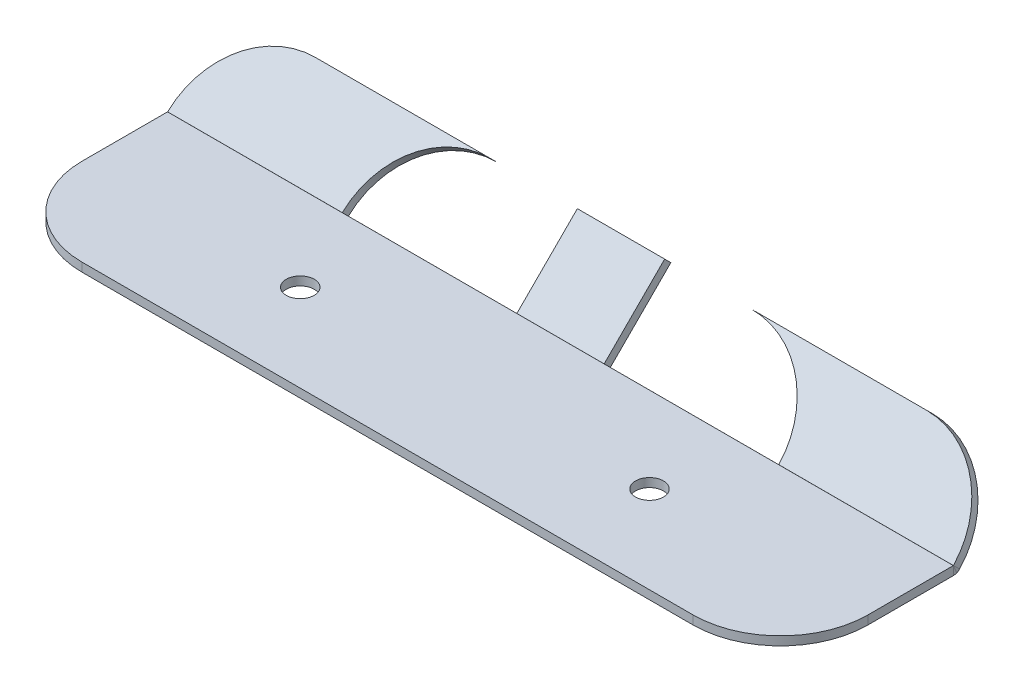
ISO-10303-21;
HEADER;
FILE_DESCRIPTION(('STEP AP214'),'2;1');
FILE_NAME('part.step','',(''),(''),'','','');
FILE_SCHEMA(('AUTOMOTIVE_DESIGN { 1 0 10303 214 1 1 1 1 }'));
ENDSEC;
DATA;
#1=APPLICATION_CONTEXT('core data for automotive mechanical design processes');
#2=APPLICATION_PROTOCOL_DEFINITION('international standard','automotive_design',2000,#1);
#3=PRODUCT_CONTEXT('',#1,'mechanical');
#4=PRODUCT('Part','Part','',(#3));
#5=PRODUCT_RELATED_PRODUCT_CATEGORY('part','',(#4));
#6=PRODUCT_DEFINITION_FORMATION('','',#4);
#7=PRODUCT_DEFINITION_CONTEXT('part definition',#1,'design');
#8=PRODUCT_DEFINITION('design','',#6,#7);
#9=PRODUCT_DEFINITION_SHAPE('','',#8);
#10=(LENGTH_UNIT() NAMED_UNIT(*) SI_UNIT(.MILLI.,.METRE.));
#11=(NAMED_UNIT(*) PLANE_ANGLE_UNIT() SI_UNIT($,.RADIAN.));
#12=(NAMED_UNIT(*) SI_UNIT($,.STERADIAN.) SOLID_ANGLE_UNIT());
#13=UNCERTAINTY_MEASURE_WITH_UNIT(LENGTH_MEASURE(1.E-05),#10,'distance_accuracy_value','');
#14=(GEOMETRIC_REPRESENTATION_CONTEXT(3) GLOBAL_UNCERTAINTY_ASSIGNED_CONTEXT((#13)) GLOBAL_UNIT_ASSIGNED_CONTEXT((#10,
#11,#12)) REPRESENTATION_CONTEXT('',''));
#15=CARTESIAN_POINT('',(0.,0.,0.));
#16=DIRECTION('',(0.,0.,1.));
#17=DIRECTION('',(1.,0.,0.));
#18=AXIS2_PLACEMENT_3D('',#15,#16,#17);
#19=CARTESIAN_POINT('',(60.,0.861312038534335,-19.6651776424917));
#20=DIRECTION('',(0.,-0.707106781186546,-0.707106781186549));
#21=DIRECTION('',(0.,0.707106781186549,-0.707106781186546));
#22=AXIS2_PLACEMENT_3D('',#19,#20,#21);
#23=CYLINDRICAL_SURFACE('',#22,10.);
#24=CARTESIAN_POINT('',(60.,0.154205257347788,-20.3722844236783));
#25=DIRECTION('',(0.,-0.707106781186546,-0.707106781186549));
#26=DIRECTION('',(0.,-0.707106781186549,0.707106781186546));
#27=AXIS2_PLACEMENT_3D('',#24,#25,#26);
#28=CIRCLE('',#27,10.);
#29=CARTESIAN_POINT('',(60.,7.22527306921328,-27.4433522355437));
#30=VERTEX_POINT('',#29);
#31=CARTESIAN_POINT('',(69.9979942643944,0.295822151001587,-20.5139013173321));
#32=VERTEX_POINT('',#31);
#33=EDGE_CURVE('E87',#30,#32,#28,.T.);
#34=ORIENTED_EDGE('',*,*,#33,.T.);
#35=CARTESIAN_POINT('',(69.9979942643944,1.00292892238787,-19.8067945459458));
#36=CARTESIAN_POINT('',(69.9979942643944,0.295822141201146,-20.5139013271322));
#37=B_SPLINE_CURVE_WITH_KNOTS('',1,(#35,#36),.UNSPECIFIED.,.F.,.F.,(2,2),(0.,1.),.UNSPECIFIED.);
#38=CARTESIAN_POINT('',(69.9979942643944,1.00292892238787,-19.8067945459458));
#39=VERTEX_POINT('',#38);
#40=EDGE_CURVE('E506',#32,#39,#37,.F.);
#41=ORIENTED_EDGE('',*,*,#40,.T.);
#42=CARTESIAN_POINT('',(60.,0.861312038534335,-19.6651776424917));
#43=DIRECTION('',(0.,-0.707106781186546,-0.707106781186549));
#44=DIRECTION('',(0.,-0.707106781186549,0.707106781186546));
#45=AXIS2_PLACEMENT_3D('',#42,#43,#44);
#46=CIRCLE('',#45,10.);
#47=CARTESIAN_POINT('',(60.,7.93237985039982,-26.7362454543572));
#48=VERTEX_POINT('',#47);
#49=EDGE_CURVE('E627',#48,#39,#46,.T.);
#50=ORIENTED_EDGE('',*,*,#49,.F.);
#51=DIRECTION('',(0.,-0.707106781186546,-0.707106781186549));
#52=VECTOR('',#51,1.);
#53=CARTESIAN_POINT('',(60.,7.93237985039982,-26.7362454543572));
#54=LINE('',#53,#52);
#55=EDGE_CURVE('E635',#48,#30,#54,.T.);
#56=ORIENTED_EDGE('',*,*,#55,.T.);
#57=EDGE_LOOP('',(#34,#41,#50,#56));
#58=FACE_BOUND('',#57,.T.);
#59=ADVANCED_FACE('F62',(#58),#23,.F.);
#60=CARTESIAN_POINT('',(80.,0.861312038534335,-19.6651776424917));
#61=DIRECTION('',(0.,-0.707106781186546,-0.707106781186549));
#62=DIRECTION('',(0.,0.707106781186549,-0.707106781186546));
#63=AXIS2_PLACEMENT_3D('',#60,#61,#62);
#64=CYLINDRICAL_SURFACE('',#63,10.);
#65=CARTESIAN_POINT('',(80.,0.861312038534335,-19.6651776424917));
#66=DIRECTION('',(0.,0.707106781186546,0.707106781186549));
#67=DIRECTION('',(0.,-0.707106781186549,0.707106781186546));
#68=AXIS2_PLACEMENT_3D('',#65,#66,#67);
#69=CIRCLE('',#68,10.);
#70=CARTESIAN_POINT('',(89.9979942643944,1.00292893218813,-19.8067945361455));
#71=VERTEX_POINT('',#70);
#72=CARTESIAN_POINT('',(79.9999999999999,7.93237985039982,-26.7362454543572));
#73=VERTEX_POINT('',#72);
#74=EDGE_CURVE('E623',#71,#73,#69,.T.);
#75=ORIENTED_EDGE('',*,*,#74,.F.);
#76=CARTESIAN_POINT('',(89.9979942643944,0.295822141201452,-20.5139013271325));
#77=CARTESIAN_POINT('',(89.9979942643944,1.00292892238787,-19.8067945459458));
#78=B_SPLINE_CURVE_WITH_KNOTS('',1,(#76,#77),.UNSPECIFIED.,.F.,.F.,(2,2),(0.,1.),.UNSPECIFIED.);
#79=CARTESIAN_POINT('',(89.9979942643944,0.295822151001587,-20.5139013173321));
#80=VERTEX_POINT('',#79);
#81=EDGE_CURVE('E12',#71,#80,#78,.F.);
#82=ORIENTED_EDGE('',*,*,#81,.T.);
#83=CARTESIAN_POINT('',(80.,0.154205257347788,-20.3722844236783));
#84=DIRECTION('',(0.,0.707106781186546,0.707106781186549));
#85=DIRECTION('',(0.,-0.707106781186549,0.707106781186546));
#86=AXIS2_PLACEMENT_3D('',#83,#84,#85);
#87=CIRCLE('',#86,10.);
#88=CARTESIAN_POINT('',(79.9999999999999,7.22527306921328,-27.4433522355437));
#89=VERTEX_POINT('',#88);
#90=EDGE_CURVE('E80',#80,#89,#87,.T.);
#91=ORIENTED_EDGE('',*,*,#90,.T.);
#92=DIRECTION('',(0.,-0.707106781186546,-0.707106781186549));
#93=VECTOR('',#92,1.);
#94=CARTESIAN_POINT('',(79.9999999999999,7.93237985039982,-26.7362454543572));
#95=LINE('',#94,#93);
#96=EDGE_CURVE('E640',#73,#89,#95,.T.);
#97=ORIENTED_EDGE('',*,*,#96,.F.);
#98=EDGE_LOOP('',(#75,#82,#91,#97));
#99=FACE_BOUND('',#98,.T.);
#100=ADVANCED_FACE('F685',(#99),#64,.T.);
#101=CARTESIAN_POINT('',(80.,0.154205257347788,-20.3722844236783));
#102=DIRECTION('',(0.,0.707106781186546,0.707106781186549));
#103=DIRECTION('',(0.,-0.707106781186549,0.707106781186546));
#104=AXIS2_PLACEMENT_3D('',#101,#102,#103);
#105=PLANE('',#104);
#106=ORIENTED_EDGE('',*,*,#90,.F.);
#107=DIRECTION('',(-1.,0.,0.));
#108=VECTOR('',#107,1.);
#109=CARTESIAN_POINT('',(80.,0.295822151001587,-20.5139013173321));
#110=LINE('',#109,#108);
#111=EDGE_CURVE('E73',#80,#32,#110,.T.);
#112=ORIENTED_EDGE('',*,*,#111,.T.);
#113=ORIENTED_EDGE('',*,*,#33,.F.);
#114=DIRECTION('',(-1.,0.,0.));
#115=VECTOR('',#114,1.);
#116=CARTESIAN_POINT('',(60.,7.22527306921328,-27.4433522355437));
#117=LINE('',#116,#115);
#118=EDGE_CURVE('E618',#89,#30,#117,.T.);
#119=ORIENTED_EDGE('',*,*,#118,.F.);
#120=EDGE_LOOP('',(#106,#112,#113,#119));
#121=FACE_BOUND('',#120,.T.);
#122=ADVANCED_FACE('F64',(#121),#105,.F.);
#123=CARTESIAN_POINT('',(80.,0.861312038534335,-19.6651776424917));
#124=DIRECTION('',(0.,0.707106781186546,0.707106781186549));
#125=DIRECTION('',(0.,-0.707106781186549,0.707106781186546));
#126=AXIS2_PLACEMENT_3D('',#123,#124,#125);
#127=PLANE('',#126);
#128=DIRECTION('',(-1.,0.,0.));
#129=VECTOR('',#128,1.);
#130=CARTESIAN_POINT('',(80.,1.00292893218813,-19.8067945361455));
#131=LINE('',#130,#129);
#132=EDGE_CURVE('E608',#71,#39,#131,.T.);
#133=ORIENTED_EDGE('',*,*,#132,.F.);
#134=ORIENTED_EDGE('',*,*,#74,.T.);
#135=DIRECTION('',(-1.,0.,0.));
#136=VECTOR('',#135,1.);
#137=CARTESIAN_POINT('',(60.,7.93237985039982,-26.7362454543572));
#138=LINE('',#137,#136);
#139=EDGE_CURVE('E633',#73,#48,#138,.T.);
#140=ORIENTED_EDGE('',*,*,#139,.T.);
#141=ORIENTED_EDGE('',*,*,#49,.T.);
#142=EDGE_LOOP('',(#133,#134,#140,#141));
#143=FACE_BOUND('',#142,.T.);
#144=ADVANCED_FACE('F630',(#143),#127,.T.);
#145=CARTESIAN_POINT('',(60.,7.93237985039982,-26.7362454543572));
#146=DIRECTION('',(0.,-0.707106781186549,0.707106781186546));
#147=DIRECTION('',(1.,0.,0.));
#148=AXIS2_PLACEMENT_3D('',#145,#146,#147);
#149=PLANE('',#148);
#150=ORIENTED_EDGE('',*,*,#118,.T.);
#151=ORIENTED_EDGE('',*,*,#55,.F.);
#152=ORIENTED_EDGE('',*,*,#139,.F.);
#153=ORIENTED_EDGE('',*,*,#96,.T.);
#154=EDGE_LOOP('',(#150,#151,#152,#153));
#155=FACE_BOUND('',#154,.T.);
#156=ADVANCED_FACE('F692',(#155),#149,.F.);
#157=CARTESIAN_POINT('',(80.,1.,-10.));
#158=DIRECTION('',(0.,-1.,0.));
#159=DIRECTION('',(0.,0.,-1.));
#160=AXIS2_PLACEMENT_3D('',#157,#158,#159);
#161=CYLINDRICAL_SURFACE('',#160,10.);
#162=CARTESIAN_POINT('',(80.,0.,-10.));
#163=DIRECTION('',(0.,1.,0.));
#164=DIRECTION('',(0.,0.,-1.));
#165=AXIS2_PLACEMENT_3D('',#162,#163,#164);
#166=CIRCLE('',#165,10.);
#167=CARTESIAN_POINT('',(79.9999999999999,0.,0.));
#168=VERTEX_POINT('',#167);
#169=CARTESIAN_POINT('',(90.,0.,-10.0000000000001));
#170=VERTEX_POINT('',#169);
#171=EDGE_CURVE('E1154',#168,#170,#166,.T.);
#172=ORIENTED_EDGE('',*,*,#171,.T.);
#173=DIRECTION('',(0.,-1.,0.));
#174=VECTOR('',#173,1.);
#175=CARTESIAN_POINT('',(90.,1.,-10.0000000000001));
#176=LINE('',#175,#174);
#177=CARTESIAN_POINT('',(90.,1.,-10.0000000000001));
#178=VERTEX_POINT('',#177);
#179=EDGE_CURVE('E1111',#178,#170,#176,.T.);
#180=ORIENTED_EDGE('',*,*,#179,.F.);
#181=CARTESIAN_POINT('',(80.,1.,-10.));
#182=DIRECTION('',(0.,1.,0.));
#183=DIRECTION('',(0.,0.,-1.));
#184=AXIS2_PLACEMENT_3D('',#181,#182,#183);
#185=CIRCLE('',#184,10.);
#186=CARTESIAN_POINT('',(79.9999999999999,1.,0.));
#187=VERTEX_POINT('',#186);
#188=EDGE_CURVE('E1122',#187,#178,#185,.T.);
#189=ORIENTED_EDGE('',*,*,#188,.F.);
#190=DIRECTION('',(0.,-1.,0.));
#191=VECTOR('',#190,1.);
#192=CARTESIAN_POINT('',(79.9999999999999,1.,0.));
#193=LINE('',#192,#191);
#194=EDGE_CURVE('E1151',#187,#168,#193,.T.);
#195=ORIENTED_EDGE('',*,*,#194,.T.);
#196=EDGE_LOOP('',(#172,#180,#189,#195));
#197=FACE_BOUND('',#196,.T.);
#198=ADVANCED_FACE('F700',(#197),#161,.T.);
#199=CARTESIAN_POINT('',(10.0000000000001,1.,0.));
#200=DIRECTION('',(0.,0.,-1.));
#201=DIRECTION('',(-1.,0.,0.));
#202=AXIS2_PLACEMENT_3D('',#199,#200,#201);
#203=PLANE('',#202);
#204=DIRECTION('',(1.,0.,0.));
#205=VECTOR('',#204,1.);
#206=CARTESIAN_POINT('',(10.0000000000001,0.,0.));
#207=LINE('',#206,#205);
#208=CARTESIAN_POINT('',(10.0000000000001,0.,0.));
#209=VERTEX_POINT('',#208);
#210=EDGE_CURVE('E1149',#209,#168,#207,.T.);
#211=ORIENTED_EDGE('',*,*,#210,.T.);
#212=ORIENTED_EDGE('',*,*,#194,.F.);
#213=DIRECTION('',(1.,0.,0.));
#214=VECTOR('',#213,1.);
#215=CARTESIAN_POINT('',(10.0000000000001,1.,0.));
#216=LINE('',#215,#214);
#217=CARTESIAN_POINT('',(10.0000000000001,1.,0.));
#218=VERTEX_POINT('',#217);
#219=EDGE_CURVE('E1124',#218,#187,#216,.T.);
#220=ORIENTED_EDGE('',*,*,#219,.F.);
#221=DIRECTION('',(0.,-1.,0.));
#222=VECTOR('',#221,1.);
#223=CARTESIAN_POINT('',(10.0000000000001,1.,0.));
#224=LINE('',#223,#222);
#225=EDGE_CURVE('E1146',#218,#209,#224,.T.);
#226=ORIENTED_EDGE('',*,*,#225,.T.);
#227=EDGE_LOOP('',(#211,#212,#220,#226));
#228=FACE_BOUND('',#227,.T.);
#229=ADVANCED_FACE('F724',(#228),#203,.F.);
#230=CARTESIAN_POINT('',(10.,1.,-10.));
#231=DIRECTION('',(0.,-1.,0.));
#232=DIRECTION('',(0.,0.,-1.));
#233=AXIS2_PLACEMENT_3D('',#230,#231,#232);
#234=CYLINDRICAL_SURFACE('',#233,10.);
#235=CARTESIAN_POINT('',(10.,0.,-10.));
#236=DIRECTION('',(0.,1.,0.));
#237=DIRECTION('',(0.,0.,-1.));
#238=AXIS2_PLACEMENT_3D('',#235,#236,#237);
#239=CIRCLE('',#238,10.);
#240=CARTESIAN_POINT('',(0.,0.,-10.0000000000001));
#241=VERTEX_POINT('',#240);
#242=EDGE_CURVE('E1144',#241,#209,#239,.T.);
#243=ORIENTED_EDGE('',*,*,#242,.T.);
#244=ORIENTED_EDGE('',*,*,#225,.F.);
#245=CARTESIAN_POINT('',(10.,1.,-10.));
#246=DIRECTION('',(0.,1.,0.));
#247=DIRECTION('',(0.,0.,-1.));
#248=AXIS2_PLACEMENT_3D('',#245,#246,#247);
#249=CIRCLE('',#248,10.);
#250=CARTESIAN_POINT('',(0.,1.,-10.0000000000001));
#251=VERTEX_POINT('',#250);
#252=EDGE_CURVE('E1126',#251,#218,#249,.T.);
#253=ORIENTED_EDGE('',*,*,#252,.F.);
#254=DIRECTION('',(0.,-1.,0.));
#255=VECTOR('',#254,1.);
#256=CARTESIAN_POINT('',(0.,1.,-10.0000000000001));
#257=LINE('',#256,#255);
#258=EDGE_CURVE('E1141',#251,#241,#257,.T.);
#259=ORIENTED_EDGE('',*,*,#258,.T.);
#260=EDGE_LOOP('',(#243,#244,#253,#259));
#261=FACE_BOUND('',#260,.T.);
#262=ADVANCED_FACE('F734',(#261),#234,.T.);
#263=CARTESIAN_POINT('',(25.,1.,-10.));
#264=DIRECTION('',(0.,-1.,0.));
#265=DIRECTION('',(0.,0.,-1.));
#266=AXIS2_PLACEMENT_3D('',#263,#264,#265);
#267=CYLINDRICAL_SURFACE('',#266,1.6);
#268=CARTESIAN_POINT('',(25.,1.,-10.));
#269=DIRECTION('',(0.,1.,0.));
#270=DIRECTION('',(0.,0.,-1.));
#271=AXIS2_PLACEMENT_3D('',#268,#269,#270);
#272=CIRCLE('',#271,1.6);
#273=CARTESIAN_POINT('',(25.,1.,-11.6));
#274=VERTEX_POINT('',#273);
#275=EDGE_CURVE('E1138',#274,#274,#272,.T.);
#276=ORIENTED_EDGE('',*,*,#275,.T.);
#277=EDGE_LOOP('',(#276));
#278=FACE_BOUND('',#277,.T.);
#279=CARTESIAN_POINT('',(25.,0.,-10.));
#280=DIRECTION('',(0.,1.,0.));
#281=DIRECTION('',(0.,0.,-1.));
#282=AXIS2_PLACEMENT_3D('',#279,#280,#281);
#283=CIRCLE('',#282,1.6);
#284=CARTESIAN_POINT('',(25.,0.,-11.6));
#285=VERTEX_POINT('',#284);
#286=EDGE_CURVE('E1114',#285,#285,#283,.T.);
#287=ORIENTED_EDGE('',*,*,#286,.F.);
#288=EDGE_LOOP('',(#287));
#289=FACE_BOUND('',#288,.T.);
#290=ADVANCED_FACE('F744',(#278,#289),#267,.F.);
#291=CARTESIAN_POINT('',(65.,1.,-10.));
#292=DIRECTION('',(0.,-1.,0.));
#293=DIRECTION('',(0.,0.,-1.));
#294=AXIS2_PLACEMENT_3D('',#291,#292,#293);
#295=CYLINDRICAL_SURFACE('',#294,1.6);
#296=CARTESIAN_POINT('',(65.,1.,-10.));
#297=DIRECTION('',(0.,1.,0.));
#298=DIRECTION('',(0.,0.,1.));
#299=AXIS2_PLACEMENT_3D('',#296,#297,#298);
#300=CIRCLE('',#299,1.6);
#301=CARTESIAN_POINT('',(65.,1.,-8.4));
#302=VERTEX_POINT('',#301);
#303=EDGE_CURVE('E1135',#302,#302,#300,.T.);
#304=ORIENTED_EDGE('',*,*,#303,.T.);
#305=EDGE_LOOP('',(#304));
#306=FACE_BOUND('',#305,.T.);
#307=CARTESIAN_POINT('',(65.,0.,-10.));
#308=DIRECTION('',(0.,1.,0.));
#309=DIRECTION('',(0.,0.,1.));
#310=AXIS2_PLACEMENT_3D('',#307,#308,#309);
#311=CIRCLE('',#310,1.6);
#312=CARTESIAN_POINT('',(65.,0.,-8.4));
#313=VERTEX_POINT('',#312);
#314=EDGE_CURVE('E1117',#313,#313,#311,.T.);
#315=ORIENTED_EDGE('',*,*,#314,.F.);
#316=EDGE_LOOP('',(#315));
#317=FACE_BOUND('',#316,.T.);
#318=ADVANCED_FACE('F754',(#306,#317),#295,.F.);
#319=CARTESIAN_POINT('',(80.,1.,-20.));
#320=DIRECTION('',(0.,1.,0.));
#321=DIRECTION('',(0.,0.,1.));
#322=AXIS2_PLACEMENT_3D('',#319,#320,#321);
#323=PLANE('',#322);
#324=ORIENTED_EDGE('',*,*,#303,.F.);
#325=EDGE_LOOP('',(#324));
#326=FACE_BOUND('',#325,.T.);
#327=ORIENTED_EDGE('',*,*,#275,.F.);
#328=EDGE_LOOP('',(#327));
#329=FACE_BOUND('',#328,.T.);
#330=DIRECTION('',(0.,0.,-1.));
#331=VECTOR('',#330,1.);
#332=CARTESIAN_POINT('',(90.,1.,-10.0000000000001));
#333=LINE('',#332,#331);
#334=CARTESIAN_POINT('',(90.,1.,-19.7997234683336));
#335=VERTEX_POINT('',#334);
#336=EDGE_CURVE('E1133',#178,#335,#333,.T.);
#337=ORIENTED_EDGE('',*,*,#336,.T.);
#338=DIRECTION('',(-1.,0.,0.));
#339=VECTOR('',#338,1.);
#340=CARTESIAN_POINT('',(80.,1.,-19.7997234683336));
#341=LINE('',#340,#339);
#342=CARTESIAN_POINT('',(0.,0.999999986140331,-19.7997234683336));
#343=VERTEX_POINT('',#342);
#344=EDGE_CURVE('E1130',#335,#343,#341,.T.);
#345=ORIENTED_EDGE('',*,*,#344,.T.);
#346=DIRECTION('',(0.,0.,1.));
#347=VECTOR('',#346,1.);
#348=CARTESIAN_POINT('',(0.,1.,-10.0000000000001));
#349=LINE('',#348,#347);
#350=EDGE_CURVE('E1128',#343,#251,#349,.T.);
#351=ORIENTED_EDGE('',*,*,#350,.T.);
#352=ORIENTED_EDGE('',*,*,#252,.T.);
#353=ORIENTED_EDGE('',*,*,#219,.T.);
#354=ORIENTED_EDGE('',*,*,#188,.T.);
#355=EDGE_LOOP('',(#337,#345,#351,#352,#353,#354));
#356=FACE_BOUND('',#355,.T.);
#357=ADVANCED_FACE('F764',(#326,#329,#356),#323,.T.);
#358=CARTESIAN_POINT('',(0.,1.,-10.0000000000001));
#359=DIRECTION('',(1.,0.,0.));
#360=DIRECTION('',(0.,0.,-1.));
#361=AXIS2_PLACEMENT_3D('',#358,#359,#360);
#362=PLANE('',#361);
#363=DIRECTION('',(0.,1.,0.));
#364=VECTOR('',#363,1.);
#365=CARTESIAN_POINT('',(0.,0.999999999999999,-19.7997234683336));
#366=LINE('',#365,#364);
#367=CARTESIAN_POINT('',(0.,0.,-19.7997234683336));
#368=VERTEX_POINT('',#367);
#369=EDGE_CURVE('E1156',#368,#343,#366,.T.);
#370=ORIENTED_EDGE('',*,*,#369,.F.);
#371=DIRECTION('',(0.,0.,1.));
#372=VECTOR('',#371,1.);
#373=CARTESIAN_POINT('',(0.,0.,-10.0000000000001));
#374=LINE('',#373,#372);
#375=EDGE_CURVE('E1120',#368,#241,#374,.T.);
#376=ORIENTED_EDGE('',*,*,#375,.T.);
#377=ORIENTED_EDGE('',*,*,#258,.F.);
#378=ORIENTED_EDGE('',*,*,#350,.F.);
#379=EDGE_LOOP('',(#370,#376,#377,#378));
#380=FACE_BOUND('',#379,.T.);
#381=ADVANCED_FACE('F774',(#380),#362,.F.);
#382=CARTESIAN_POINT('',(80.,0.,-20.));
#383=DIRECTION('',(0.,1.,0.));
#384=DIRECTION('',(0.,0.,1.));
#385=AXIS2_PLACEMENT_3D('',#382,#383,#384);
#386=PLANE('',#385);
#387=DIRECTION('',(-1.,0.,0.));
#388=VECTOR('',#387,1.);
#389=CARTESIAN_POINT('',(80.,0.,-19.7997234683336));
#390=LINE('',#389,#388);
#391=CARTESIAN_POINT('',(90.,0.,-19.7997234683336));
#392=VERTEX_POINT('',#391);
#393=EDGE_CURVE('E1158',#392,#368,#390,.T.);
#394=ORIENTED_EDGE('',*,*,#393,.F.);
#395=DIRECTION('',(0.,0.,-1.));
#396=VECTOR('',#395,1.);
#397=CARTESIAN_POINT('',(90.,0.,-10.0000000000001));
#398=LINE('',#397,#396);
#399=EDGE_CURVE('E619',#170,#392,#398,.T.);
#400=ORIENTED_EDGE('',*,*,#399,.F.);
#401=ORIENTED_EDGE('',*,*,#171,.F.);
#402=ORIENTED_EDGE('',*,*,#210,.F.);
#403=ORIENTED_EDGE('',*,*,#242,.F.);
#404=ORIENTED_EDGE('',*,*,#375,.F.);
#405=EDGE_LOOP('',(#394,#400,#401,#402,#403,#404));
#406=FACE_BOUND('',#405,.T.);
#407=ORIENTED_EDGE('',*,*,#314,.T.);
#408=EDGE_LOOP('',(#407));
#409=FACE_BOUND('',#408,.T.);
#410=ORIENTED_EDGE('',*,*,#286,.T.);
#411=EDGE_LOOP('',(#410));
#412=FACE_BOUND('',#411,.T.);
#413=ADVANCED_FACE('F784',(#406,#409,#412),#386,.F.);
#414=CARTESIAN_POINT('',(90.,1.,-10.0000000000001));
#415=DIRECTION('',(-1.,0.,0.));
#416=DIRECTION('',(0.,0.,1.));
#417=AXIS2_PLACEMENT_3D('',#414,#415,#416);
#418=PLANE('',#417);
#419=DIRECTION('',(0.,-1.,0.));
#420=VECTOR('',#419,1.);
#421=CARTESIAN_POINT('',(90.,0.999999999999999,-19.7997234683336));
#422=LINE('',#421,#420);
#423=EDGE_CURVE('E1160',#335,#392,#422,.T.);
#424=ORIENTED_EDGE('',*,*,#423,.F.);
#425=ORIENTED_EDGE('',*,*,#336,.F.);
#426=ORIENTED_EDGE('',*,*,#179,.T.);
#427=ORIENTED_EDGE('',*,*,#399,.T.);
#428=EDGE_LOOP('',(#424,#425,#426,#427));
#429=FACE_BOUND('',#428,.T.);
#430=ADVANCED_FACE('F795',(#429),#418,.F.);
#431=CARTESIAN_POINT('',(90.,1.01000001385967,-19.7997234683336));
#432=DIRECTION('',(-1.,0.,0.));
#433=DIRECTION('',(0.,0.,1.));
#434=AXIS2_PLACEMENT_3D('',#431,#432,#433);
#435=PLANE('',#434);
#436=ORIENTED_EDGE('',*,*,#423,.T.);
#437=CARTESIAN_POINT('',(90.,1.01,-19.7997234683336));
#438=DIRECTION('',(-1.,0.,0.));
#439=DIRECTION('',(0.,0.,1.));
#440=AXIS2_PLACEMENT_3D('',#437,#438,#439);
#441=CIRCLE('',#440,1.01000001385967);
#442=CARTESIAN_POINT('',(90.,0.0768816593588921,-20.1862337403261));
#443=VERTEX_POINT('',#442);
#444=EDGE_CURVE('E261',#392,#443,#441,.F.);
#445=ORIENTED_EDGE('',*,*,#444,.T.);
#446=CARTESIAN_POINT('',(90.,1.00076119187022,-19.8035503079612));
#447=CARTESIAN_POINT('',(90.,0.0768816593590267,-20.1862337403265));
#448=B_SPLINE_CURVE_WITH_KNOTS('',1,(#446,#447),.UNSPECIFIED.,.F.,.F.,(2,2),(0.,1.),.UNSPECIFIED.);
#449=CARTESIAN_POINT('',(90.,1.00076119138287,-19.803550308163));
#450=VERTEX_POINT('',#449);
#451=EDGE_CURVE('E1087',#443,#450,#448,.F.);
#452=ORIENTED_EDGE('',*,*,#451,.T.);
#453=CARTESIAN_POINT('',(90.,1.01000001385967,-19.7997234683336));
#454=DIRECTION('',(1.,0.,0.));
#455=DIRECTION('',(0.,0.,-1.));
#456=AXIS2_PLACEMENT_3D('',#453,#454,#455);
#457=CIRCLE('',#456,0.0100000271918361);
#458=EDGE_CURVE('E587',#335,#450,#457,.T.);
#459=ORIENTED_EDGE('',*,*,#458,.F.);
#460=EDGE_LOOP('',(#436,#445,#452,#459));
#461=FACE_BOUND('',#460,.T.);
#462=ADVANCED_FACE('F806',(#461),#435,.F.);
#463=CARTESIAN_POINT('',(90.,0.0768816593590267,-20.1862337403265));
#464=CARTESIAN_POINT('',(89.9997601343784,0.133123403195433,-20.3220133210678));
#465=CARTESIAN_POINT('',(89.9990898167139,0.212755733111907,-20.4308349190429));
#466=CARTESIAN_POINT('',(89.9979942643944,0.295822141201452,-20.5139013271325));
#467=CARTESIAN_POINT('',(90.,1.00076119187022,-19.8035503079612));
#468=CARTESIAN_POINT('',(89.9997599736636,1.00131841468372,-19.8048955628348));
#469=CARTESIAN_POINT('',(89.9990913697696,1.00210531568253,-19.8059709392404));
#470=CARTESIAN_POINT('',(89.9979942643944,1.00292892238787,-19.8067945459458));
#471=B_SPLINE_SURFACE_WITH_KNOTS('',1,3,((#463,#464,#465,#466),(#467,#468,#469,#470)),
.UNSPECIFIED.,.F.,.F.,.F.,(2,2),(4,4),(0.,1.),(0.,1.),.UNSPECIFIED.);
#472=CARTESIAN_POINT('',(90.,0.0768816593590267,-20.1862337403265));
#473=CARTESIAN_POINT('',(89.9997601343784,0.133123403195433,-20.3220133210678));
#474=CARTESIAN_POINT('',(89.9990898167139,0.212755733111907,-20.4308349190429));
#475=CARTESIAN_POINT('',(89.9979942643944,0.295822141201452,-20.5139013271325));
#476=B_SPLINE_CURVE_WITH_KNOTS('',3,(#472,#473,#474,#475),.UNSPECIFIED.,.F.,.F.,(4,4),(0.,1.),.UNSPECIFIED.);
#477=EDGE_CURVE('E511',#443,#80,#476,.T.);
#478=CARTESIAN_POINT('',(89.9979942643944,1.00292892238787,-19.8067945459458));
#479=CARTESIAN_POINT('',(89.9990913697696,1.00210531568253,-19.8059709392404));
#480=CARTESIAN_POINT('',(89.9997599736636,1.00131841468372,-19.8048955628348));
#481=CARTESIAN_POINT('',(90.,1.00076119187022,-19.8035503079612));
#482=B_SPLINE_CURVE_WITH_KNOTS('',3,(#478,#479,#480,#481),.UNSPECIFIED.,.F.,.F.,(4,4),(0.,1.),.UNSPECIFIED.);
#483=EDGE_CURVE('E533',#450,#71,#482,.F.);
#484=ORIENTED_EDGE('',*,*,#451,.F.);
#485=ORIENTED_EDGE('',*,*,#477,.T.);
#486=ORIENTED_EDGE('',*,*,#81,.F.);
#487=ORIENTED_EDGE('',*,*,#483,.F.);
#488=EDGE_LOOP('',(#484,#485,#486,#487));
#489=FACE_BOUND('',#488,.T.);
#490=ADVANCED_FACE('F475',(#489),#471,.F.);
#491=CARTESIAN_POINT('',(69.9979942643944,0.295822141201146,-20.5139013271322));
#492=CARTESIAN_POINT('',(69.9990898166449,0.21275574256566,-20.4308349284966));
#493=CARTESIAN_POINT('',(69.9997601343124,0.133123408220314,-20.322013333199));
#494=CARTESIAN_POINT('',(70.,0.0768816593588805,-20.1862337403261));
#495=CARTESIAN_POINT('',(69.9979942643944,1.00292892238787,-19.8067945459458));
#496=CARTESIAN_POINT('',(69.9990913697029,1.00210531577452,-19.8059709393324));
#497=CARTESIAN_POINT('',(69.9997599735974,1.00131841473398,-19.8048955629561));
#498=CARTESIAN_POINT('',(70.,1.00076119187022,-19.8035503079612));
#499=B_SPLINE_SURFACE_WITH_KNOTS('',1,3,((#491,#492,#493,#494),(#495,#496,#497,#498)),
.UNSPECIFIED.,.F.,.F.,.F.,(2,2),(4,4),(0.,1.),(0.,1.),.UNSPECIFIED.);
#500=CARTESIAN_POINT('',(69.9979942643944,0.295822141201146,-20.5139013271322));
#501=CARTESIAN_POINT('',(69.9990898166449,0.21275574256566,-20.4308349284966));
#502=CARTESIAN_POINT('',(69.9997601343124,0.133123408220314,-20.322013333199));
#503=CARTESIAN_POINT('',(70.,0.0768816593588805,-20.1862337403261));
#504=B_SPLINE_CURVE_WITH_KNOTS('',3,(#500,#501,#502,#503),.UNSPECIFIED.,.F.,.F.,(4,4),(0.,1.),.UNSPECIFIED.);
#505=CARTESIAN_POINT('',(70.,0.0768816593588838,-20.1862337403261));
#506=VERTEX_POINT('',#505);
#507=EDGE_CURVE('E505',#32,#506,#504,.T.);
#508=CARTESIAN_POINT('',(70.,0.0768816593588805,-20.1862337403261));
#509=CARTESIAN_POINT('',(70.,1.00076119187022,-19.8035503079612));
#510=B_SPLINE_CURVE_WITH_KNOTS('',1,(#508,#509),.UNSPECIFIED.,.F.,.F.,(2,2),(0.,1.),.UNSPECIFIED.);
#511=CARTESIAN_POINT('',(70.,1.00076119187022,-19.8035503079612));
#512=VERTEX_POINT('',#511);
#513=EDGE_CURVE('E451',#506,#512,#510,.T.);
#514=CARTESIAN_POINT('',(70.,1.00076119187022,-19.8035503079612));
#515=CARTESIAN_POINT('',(69.9997599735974,1.00131841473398,-19.8048955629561));
#516=CARTESIAN_POINT('',(69.9990913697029,1.00210531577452,-19.8059709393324));
#517=CARTESIAN_POINT('',(69.9979942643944,1.00292892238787,-19.8067945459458));
#518=B_SPLINE_CURVE_WITH_KNOTS('',3,(#514,#515,#516,#517),.UNSPECIFIED.,.F.,.F.,(4,4),(0.,1.),.UNSPECIFIED.);
#519=EDGE_CURVE('E604',#39,#512,#518,.F.);
#520=ORIENTED_EDGE('',*,*,#40,.F.);
#521=ORIENTED_EDGE('',*,*,#507,.T.);
#522=ORIENTED_EDGE('',*,*,#513,.T.);
#523=ORIENTED_EDGE('',*,*,#519,.F.);
#524=EDGE_LOOP('',(#520,#521,#522,#523));
#525=FACE_BOUND('',#524,.T.);
#526=ADVANCED_FACE('F462',(#525),#499,.F.);
#527=CARTESIAN_POINT('',(60.,1.00076119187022,-19.8035503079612));
#528=DIRECTION('',(0.,-0.382683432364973,0.923879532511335));
#529=DIRECTION('',(-1.,0.,0.));
#530=AXIS2_PLACEMENT_3D('',#527,#528,#529);
#531=PLANE('',#530);
#532=ORIENTED_EDGE('',*,*,#513,.F.);
#533=DIRECTION('',(-1.,0.,0.));
#534=VECTOR('',#533,1.);
#535=CARTESIAN_POINT('',(135.006446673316,0.0768816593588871,-20.1862337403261));
#536=LINE('',#535,#534);
#537=CARTESIAN_POINT('',(50.,0.0768816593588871,-20.1862337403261));
#538=VERTEX_POINT('',#537);
#539=EDGE_CURVE('E297',#506,#538,#536,.T.);
#540=ORIENTED_EDGE('',*,*,#539,.T.);
#541=DIRECTION('',(0.,0.923879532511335,0.382683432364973));
#542=VECTOR('',#541,1.);
#543=CARTESIAN_POINT('',(50.,1.00076119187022,-19.8035503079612));
#544=LINE('',#543,#542);
#545=CARTESIAN_POINT('',(50.,1.00076119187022,-19.8035503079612));
#546=VERTEX_POINT('',#545);
#547=EDGE_CURVE('E449',#538,#546,#544,.T.);
#548=ORIENTED_EDGE('',*,*,#547,.T.);
#549=DIRECTION('',(-1.,0.,0.));
#550=VECTOR('',#549,1.);
#551=CARTESIAN_POINT('',(70.,1.00076119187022,-19.8035503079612));
#552=LINE('',#551,#550);
#553=EDGE_CURVE('E302',#512,#546,#552,.T.);
#554=ORIENTED_EDGE('',*,*,#553,.F.);
#555=EDGE_LOOP('',(#532,#540,#548,#554));
#556=FACE_BOUND('',#555,.T.);
#557=ADVANCED_FACE('F474',(#556),#531,.F.);
#558=CARTESIAN_POINT('',(50.,1.01000001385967,-19.7997234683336));
#559=DIRECTION('',(-1.,0.,0.));
#560=DIRECTION('',(0.,0.,1.));
#561=AXIS2_PLACEMENT_3D('',#558,#559,#560);
#562=PLANE('',#561);
#563=ORIENTED_EDGE('',*,*,#547,.F.);
#564=CARTESIAN_POINT('',(50.,1.01,-19.7997234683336));
#565=DIRECTION('',(-1.,0.,0.));
#566=DIRECTION('',(0.,0.,1.));
#567=AXIS2_PLACEMENT_3D('',#564,#565,#566);
#568=CIRCLE('',#567,1.01000001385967);
#569=CARTESIAN_POINT('',(50.,0.295822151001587,-20.5139013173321));
#570=VERTEX_POINT('',#569);
#571=EDGE_CURVE('E294',#538,#570,#568,.F.);
#572=ORIENTED_EDGE('',*,*,#571,.T.);
#573=DIRECTION('',(0.,-0.707106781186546,-0.707106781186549));
#574=VECTOR('',#573,1.);
#575=CARTESIAN_POINT('',(50.,1.00292893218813,-19.8067945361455));
#576=LINE('',#575,#574);
#577=CARTESIAN_POINT('',(50.,1.00292893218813,-19.8067945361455));
#578=VERTEX_POINT('',#577);
#579=EDGE_CURVE('E271',#578,#570,#576,.T.);
#580=ORIENTED_EDGE('',*,*,#579,.F.);
#581=CARTESIAN_POINT('',(50.,1.01000001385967,-19.7997234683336));
#582=DIRECTION('',(1.,0.,0.));
#583=DIRECTION('',(0.,0.,-1.));
#584=AXIS2_PLACEMENT_3D('',#581,#582,#583);
#585=CIRCLE('',#584,0.0100000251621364);
#586=EDGE_CURVE('E298',#546,#578,#585,.T.);
#587=ORIENTED_EDGE('',*,*,#586,.F.);
#588=EDGE_LOOP('',(#563,#572,#580,#587));
#589=FACE_BOUND('',#588,.T.);
#590=ADVANCED_FACE('F657',(#589),#562,.F.);
#591=CARTESIAN_POINT('',(40.,1.01000001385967,-19.7997234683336));
#592=DIRECTION('',(1.,0.,0.));
#593=DIRECTION('',(0.,0.,-1.));
#594=AXIS2_PLACEMENT_3D('',#591,#592,#593);
#595=PLANE('',#594);
#596=DIRECTION('',(0.,0.707106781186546,0.707106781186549));
#597=VECTOR('',#596,1.);
#598=CARTESIAN_POINT('',(40.,1.00292893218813,-19.8067945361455));
#599=LINE('',#598,#597);
#600=CARTESIAN_POINT('',(40.,0.295822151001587,-20.5139013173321));
#601=VERTEX_POINT('',#600);
#602=CARTESIAN_POINT('',(40.,1.00292892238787,-19.8067945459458));
#603=VERTEX_POINT('',#602);
#604=EDGE_CURVE('E262',#601,#603,#599,.T.);
#605=ORIENTED_EDGE('',*,*,#604,.F.);
#606=CARTESIAN_POINT('',(40.,1.01,-19.7997234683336));
#607=DIRECTION('',(-1.,0.,0.));
#608=DIRECTION('',(0.,0.,1.));
#609=AXIS2_PLACEMENT_3D('',#606,#607,#608);
#610=CIRCLE('',#609,1.01000001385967);
#611=CARTESIAN_POINT('',(40.,0.0768816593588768,-20.1862337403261));
#612=VERTEX_POINT('',#611);
#613=EDGE_CURVE('E290',#601,#612,#610,.T.);
#614=ORIENTED_EDGE('',*,*,#613,.T.);
#615=DIRECTION('',(0.,0.923879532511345,0.382683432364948));
#616=VECTOR('',#615,1.);
#617=CARTESIAN_POINT('',(40.,1.00076119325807,-19.8035503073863));
#618=LINE('',#617,#616);
#619=CARTESIAN_POINT('',(40.,1.00076119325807,-19.8035503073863));
#620=VERTEX_POINT('',#619);
#621=EDGE_CURVE('E442',#612,#620,#618,.T.);
#622=ORIENTED_EDGE('',*,*,#621,.T.);
#623=CARTESIAN_POINT('',(40.,1.01000001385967,-19.7997234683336));
#624=DIRECTION('',(-1.,0.,0.));
#625=DIRECTION('',(0.,0.,1.));
#626=AXIS2_PLACEMENT_3D('',#623,#624,#625);
#627=CIRCLE('',#626,0.0100000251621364);
#628=EDGE_CURVE('E301',#603,#620,#627,.T.);
#629=ORIENTED_EDGE('',*,*,#628,.F.);
#630=EDGE_LOOP('',(#605,#614,#622,#629));
#631=FACE_BOUND('',#630,.T.);
#632=ADVANCED_FACE('F672',(#631),#595,.F.);
#633=CARTESIAN_POINT('',(30.,1.00076119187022,-19.8035503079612));
#634=DIRECTION('',(0.,-0.382683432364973,0.923879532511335));
#635=DIRECTION('',(-1.,0.,0.));
#636=AXIS2_PLACEMENT_3D('',#633,#634,#635);
#637=PLANE('',#636);
#638=ORIENTED_EDGE('',*,*,#621,.F.);
#639=DIRECTION('',(-1.,0.,0.));
#640=VECTOR('',#639,1.);
#641=CARTESIAN_POINT('',(30.,0.0768816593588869,-20.1862337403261));
#642=LINE('',#641,#640);
#643=CARTESIAN_POINT('',(20.,0.0768816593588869,-20.1862337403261));
#644=VERTEX_POINT('',#643);
#645=EDGE_CURVE('E293',#612,#644,#642,.T.);
#646=ORIENTED_EDGE('',*,*,#645,.T.);
#647=CARTESIAN_POINT('',(20.,1.00076119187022,-19.8035503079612));
#648=CARTESIAN_POINT('',(20.,0.0768816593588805,-20.1862337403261));
#649=B_SPLINE_CURVE_WITH_KNOTS('',1,(#647,#648),.UNSPECIFIED.,.F.,.F.,(2,2),(0.,1.),.UNSPECIFIED.);
#650=CARTESIAN_POINT('',(20.,1.00076119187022,-19.8035503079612));
#651=VERTEX_POINT('',#650);
#652=EDGE_CURVE('E430',#644,#651,#649,.F.);
#653=ORIENTED_EDGE('',*,*,#652,.T.);
#654=DIRECTION('',(-1.,0.,0.));
#655=VECTOR('',#654,1.);
#656=CARTESIAN_POINT('',(40.,1.00076119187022,-19.8035503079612));
#657=LINE('',#656,#655);
#658=EDGE_CURVE('E305',#620,#651,#657,.T.);
#659=ORIENTED_EDGE('',*,*,#658,.F.);
#660=EDGE_LOOP('',(#638,#646,#653,#659));
#661=FACE_BOUND('',#660,.T.);
#662=ADVANCED_FACE('F401',(#661),#637,.F.);
#663=CARTESIAN_POINT('',(20.,0.0768816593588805,-20.1862337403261));
#664=CARTESIAN_POINT('',(20.0002398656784,0.133123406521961,-20.3220133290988));
#665=CARTESIAN_POINT('',(20.0009101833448,0.212755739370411,-20.4308349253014));
#666=CARTESIAN_POINT('',(20.0020057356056,0.295822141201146,-20.5139013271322));
#667=CARTESIAN_POINT('',(20.,1.00076119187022,-19.8035503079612));
#668=CARTESIAN_POINT('',(20.0002400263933,1.00131841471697,-19.8048955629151));
#669=CARTESIAN_POINT('',(20.0009086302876,1.00210531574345,-19.8059709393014));
#670=CARTESIAN_POINT('',(20.0020057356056,1.00292892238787,-19.8067945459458));
#671=B_SPLINE_SURFACE_WITH_KNOTS('',1,3,((#663,#664,#665,#666),(#667,#668,#669,#670)),
.UNSPECIFIED.,.F.,.F.,.F.,(2,2),(4,4),(0.,1.),(0.,1.),.UNSPECIFIED.);
#672=CARTESIAN_POINT('',(20.,0.0768816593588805,-20.1862337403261));
#673=CARTESIAN_POINT('',(20.0002398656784,0.133123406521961,-20.3220133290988));
#674=CARTESIAN_POINT('',(20.0009101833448,0.212755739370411,-20.4308349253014));
#675=CARTESIAN_POINT('',(20.0020057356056,0.295822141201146,-20.5139013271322));
#676=B_SPLINE_CURVE_WITH_KNOTS('',3,(#672,#673,#674,#675),.UNSPECIFIED.,.F.,.F.,(4,4),(0.,1.),.UNSPECIFIED.);
#677=CARTESIAN_POINT('',(20.0020057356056,0.295822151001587,-20.5139013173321));
#678=VERTEX_POINT('',#677);
#679=EDGE_CURVE('E371',#644,#678,#676,.T.);
#680=CARTESIAN_POINT('',(20.0020057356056,0.295822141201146,-20.5139013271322));
#681=CARTESIAN_POINT('',(20.0020057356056,1.00292892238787,-19.8067945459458));
#682=B_SPLINE_CURVE_WITH_KNOTS('',1,(#680,#681),.UNSPECIFIED.,.F.,.F.,(2,2),(0.,1.),.UNSPECIFIED.);
#683=CARTESIAN_POINT('',(20.0020057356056,1.00292893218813,-19.8067945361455));
#684=VERTEX_POINT('',#683);
#685=EDGE_CURVE('E233',#684,#678,#682,.F.);
#686=CARTESIAN_POINT('',(20.0020057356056,1.00292892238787,-19.8067945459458));
#687=CARTESIAN_POINT('',(20.0009086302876,1.00210531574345,-19.8059709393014));
#688=CARTESIAN_POINT('',(20.0002400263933,1.00131841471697,-19.8048955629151));
#689=CARTESIAN_POINT('',(20.,1.00076119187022,-19.8035503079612));
#690=B_SPLINE_CURVE_WITH_KNOTS('',3,(#686,#687,#688,#689),.UNSPECIFIED.,.F.,.F.,(4,4),(0.,1.),.UNSPECIFIED.);
#691=EDGE_CURVE('E362',#651,#684,#690,.F.);
#692=ORIENTED_EDGE('',*,*,#652,.F.);
#693=ORIENTED_EDGE('',*,*,#679,.T.);
#694=ORIENTED_EDGE('',*,*,#685,.F.);
#695=ORIENTED_EDGE('',*,*,#691,.F.);
#696=EDGE_LOOP('',(#692,#693,#694,#695));
#697=FACE_BOUND('',#696,.T.);
#698=ADVANCED_FACE('F390',(#697),#671,.F.);
#699=CARTESIAN_POINT('',(0.00200573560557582,0.295822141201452,-20.5139013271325));
#700=CARTESIAN_POINT('',(0.000910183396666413,0.212755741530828,-20.4308349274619));
#701=CARTESIAN_POINT('',(0.000239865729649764,0.133123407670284,-20.3220133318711));
#702=CARTESIAN_POINT('',(0.,0.0768816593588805,-20.1862337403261));
#703=CARTESIAN_POINT('',(0.00200573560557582,1.00292892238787,-19.8067945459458));
#704=CARTESIAN_POINT('',(0.000908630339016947,1.00210531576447,-19.8059709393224));
#705=CARTESIAN_POINT('',(0.000240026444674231,1.00131841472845,-19.8048955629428));
#706=CARTESIAN_POINT('',(0.,1.00076119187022,-19.8035503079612));
#707=B_SPLINE_SURFACE_WITH_KNOTS('',1,3,((#699,#700,#701,#702),(#703,#704,#705,#706)),
.UNSPECIFIED.,.F.,.F.,.F.,(2,2),(4,4),(0.,1.),(0.,1.),.UNSPECIFIED.);
#708=CARTESIAN_POINT('',(0.00200573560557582,1.00292892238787,-19.8067945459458));
#709=CARTESIAN_POINT('',(0.00200573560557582,0.295822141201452,-20.5139013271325));
#710=B_SPLINE_CURVE_WITH_KNOTS('',1,(#708,#709),.UNSPECIFIED.,.F.,.F.,(2,2),(0.,1.),.UNSPECIFIED.);
#711=CARTESIAN_POINT('',(0.00200573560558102,0.295822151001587,-20.5139013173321));
#712=VERTEX_POINT('',#711);
#713=CARTESIAN_POINT('',(0.00200573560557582,1.00292892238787,-19.8067945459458));
#714=VERTEX_POINT('',#713);
#715=EDGE_CURVE('E554',#712,#714,#710,.F.);
#716=CARTESIAN_POINT('',(0.00200573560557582,0.295822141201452,-20.5139013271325));
#717=CARTESIAN_POINT('',(0.000910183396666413,0.212755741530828,-20.4308349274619));
#718=CARTESIAN_POINT('',(0.000239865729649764,0.133123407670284,-20.3220133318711));
#719=CARTESIAN_POINT('',(0.,0.0768816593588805,-20.1862337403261));
#720=B_SPLINE_CURVE_WITH_KNOTS('',3,(#716,#717,#718,#719),.UNSPECIFIED.,.F.,.F.,(4,4),(0.,1.),.UNSPECIFIED.);
#721=CARTESIAN_POINT('',(0.,0.0768816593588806,-20.1862337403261));
#722=VERTEX_POINT('',#721);
#723=EDGE_CURVE('E563',#712,#722,#720,.T.);
#724=CARTESIAN_POINT('',(0.,0.0768816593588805,-20.1862337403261));
#725=CARTESIAN_POINT('',(0.,1.00076119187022,-19.8035503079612));
#726=B_SPLINE_CURVE_WITH_KNOTS('',1,(#724,#725),.UNSPECIFIED.,.F.,.F.,(2,2),(0.,1.),.UNSPECIFIED.);
#727=CARTESIAN_POINT('',(0.,1.00076119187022,-19.8035503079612));
#728=VERTEX_POINT('',#727);
#729=EDGE_CURVE('E1191',#722,#728,#726,.T.);
#730=CARTESIAN_POINT('',(0.,1.00076119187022,-19.8035503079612));
#731=CARTESIAN_POINT('',(0.000240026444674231,1.00131841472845,-19.8048955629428));
#732=CARTESIAN_POINT('',(0.000908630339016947,1.00210531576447,-19.8059709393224));
#733=CARTESIAN_POINT('',(0.00200573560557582,1.00292892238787,-19.8067945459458));
#734=B_SPLINE_CURVE_WITH_KNOTS('',3,(#730,#731,#732,#733),.UNSPECIFIED.,.F.,.F.,(4,4),(0.,1.),.UNSPECIFIED.);
#735=EDGE_CURVE('E565',#714,#728,#734,.F.);
#736=ORIENTED_EDGE('',*,*,#715,.F.);
#737=ORIENTED_EDGE('',*,*,#723,.T.);
#738=ORIENTED_EDGE('',*,*,#729,.T.);
#739=ORIENTED_EDGE('',*,*,#735,.F.);
#740=EDGE_LOOP('',(#736,#737,#738,#739));
#741=FACE_BOUND('',#740,.T.);
#742=ADVANCED_FACE('F325',(#741),#707,.F.);
#743=CARTESIAN_POINT('',(0.,1.01000001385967,-19.7997234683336));
#744=DIRECTION('',(1.,0.,0.));
#745=DIRECTION('',(0.,0.,-1.));
#746=AXIS2_PLACEMENT_3D('',#743,#744,#745);
#747=PLANE('',#746);
#748=CARTESIAN_POINT('',(0.,1.01,-19.7997234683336));
#749=DIRECTION('',(-1.,0.,0.));
#750=DIRECTION('',(0.,0.,1.));
#751=AXIS2_PLACEMENT_3D('',#748,#749,#750);
#752=CIRCLE('',#751,1.01000001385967);
#753=EDGE_CURVE('E574',#722,#368,#752,.T.);
#754=ORIENTED_EDGE('',*,*,#753,.T.);
#755=ORIENTED_EDGE('',*,*,#369,.T.);
#756=CARTESIAN_POINT('',(0.,1.01000001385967,-19.7997234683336));
#757=DIRECTION('',(-1.,0.,0.));
#758=DIRECTION('',(0.,0.,1.));
#759=AXIS2_PLACEMENT_3D('',#756,#757,#758);
#760=CIRCLE('',#759,0.0100000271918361);
#761=EDGE_CURVE('E1189',#728,#343,#760,.T.);
#762=ORIENTED_EDGE('',*,*,#761,.F.);
#763=ORIENTED_EDGE('',*,*,#729,.F.);
#764=EDGE_LOOP('',(#754,#755,#762,#763));
#765=FACE_BOUND('',#764,.T.);
#766=ADVANCED_FACE('F323',(#765),#747,.F.);
#767=CARTESIAN_POINT('',(135.006446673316,1.01,-19.7997234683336));
#768=DIRECTION('',(-1.,0.,0.));
#769=DIRECTION('',(0.,0.,1.));
#770=AXIS2_PLACEMENT_3D('',#767,#768,#769);
#771=CYLINDRICAL_SURFACE('',#770,0.0100000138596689);
#772=ORIENTED_EDGE('',*,*,#735,.T.);
#773=ORIENTED_EDGE('',*,*,#761,.T.);
#774=ORIENTED_EDGE('',*,*,#344,.F.);
#775=ORIENTED_EDGE('',*,*,#458,.T.);
#776=ORIENTED_EDGE('',*,*,#483,.T.);
#777=ORIENTED_EDGE('',*,*,#132,.T.);
#778=ORIENTED_EDGE('',*,*,#519,.T.);
#779=ORIENTED_EDGE('',*,*,#553,.T.);
#780=ORIENTED_EDGE('',*,*,#586,.T.);
#781=DIRECTION('',(-1.,0.,0.));
#782=VECTOR('',#781,1.);
#783=CARTESIAN_POINT('',(80.,1.00292893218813,-19.8067945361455));
#784=LINE('',#783,#782);
#785=EDGE_CURVE('E286',#578,#603,#784,.T.);
#786=ORIENTED_EDGE('',*,*,#785,.T.);
#787=ORIENTED_EDGE('',*,*,#628,.T.);
#788=ORIENTED_EDGE('',*,*,#658,.T.);
#789=ORIENTED_EDGE('',*,*,#691,.T.);
#790=DIRECTION('',(-1.,0.,0.));
#791=VECTOR('',#790,1.);
#792=CARTESIAN_POINT('',(80.,1.00292893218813,-19.8067945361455));
#793=LINE('',#792,#791);
#794=EDGE_CURVE('E252',#684,#714,#793,.T.);
#795=ORIENTED_EDGE('',*,*,#794,.T.);
#796=EDGE_LOOP('',(#772,#773,#774,#775,#776,#777,#778,#779,#780,#786,#787,#788,#789,#795));
#797=FACE_BOUND('',#796,.T.);
#798=ADVANCED_FACE('F312',(#797),#771,.F.);
#799=CARTESIAN_POINT('',(135.006446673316,1.01,-19.7997234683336));
#800=DIRECTION('',(-1.,0.,0.));
#801=DIRECTION('',(0.,0.,1.));
#802=AXIS2_PLACEMENT_3D('',#799,#800,#801);
#803=CYLINDRICAL_SURFACE('',#802,1.01000001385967);
#804=ORIENTED_EDGE('',*,*,#723,.F.);
#805=DIRECTION('',(-1.,0.,0.));
#806=VECTOR('',#805,1.);
#807=CARTESIAN_POINT('',(80.,0.295822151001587,-20.5139013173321));
#808=LINE('',#807,#806);
#809=EDGE_CURVE('E239',#678,#712,#808,.T.);
#810=ORIENTED_EDGE('',*,*,#809,.F.);
#811=ORIENTED_EDGE('',*,*,#679,.F.);
#812=ORIENTED_EDGE('',*,*,#645,.F.);
#813=ORIENTED_EDGE('',*,*,#613,.F.);
#814=DIRECTION('',(-1.,0.,0.));
#815=VECTOR('',#814,1.);
#816=CARTESIAN_POINT('',(80.,0.295822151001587,-20.5139013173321));
#817=LINE('',#816,#815);
#818=EDGE_CURVE('E266',#570,#601,#817,.T.);
#819=ORIENTED_EDGE('',*,*,#818,.F.);
#820=ORIENTED_EDGE('',*,*,#571,.F.);
#821=ORIENTED_EDGE('',*,*,#539,.F.);
#822=ORIENTED_EDGE('',*,*,#507,.F.);
#823=ORIENTED_EDGE('',*,*,#111,.F.);
#824=ORIENTED_EDGE('',*,*,#477,.F.);
#825=ORIENTED_EDGE('',*,*,#444,.F.);
#826=ORIENTED_EDGE('',*,*,#393,.T.);
#827=ORIENTED_EDGE('',*,*,#753,.F.);
#828=EDGE_LOOP('',(#804,#810,#811,#812,#813,#819,#820,#821,#822,#823,#824,#825,#826,#827));
#829=FACE_BOUND('',#828,.T.);
#830=ADVANCED_FACE('F322',(#829),#803,.T.);
#831=CARTESIAN_POINT('',(40.,7.93237985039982,-26.7362454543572));
#832=DIRECTION('',(0.,-0.707106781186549,0.707106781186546));
#833=DIRECTION('',(1.,0.,0.));
#834=AXIS2_PLACEMENT_3D('',#831,#832,#833);
#835=PLANE('',#834);
#836=DIRECTION('',(-1.,0.,0.));
#837=VECTOR('',#836,1.);
#838=CARTESIAN_POINT('',(40.,7.22527306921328,-27.4433522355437));
#839=LINE('',#838,#837);
#840=CARTESIAN_POINT('',(50.,7.22527306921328,-27.4433522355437));
#841=VERTEX_POINT('',#840);
#842=CARTESIAN_POINT('',(40.,7.22527306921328,-27.4433522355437));
#843=VERTEX_POINT('',#842);
#844=EDGE_CURVE('E284',#841,#843,#839,.T.);
#845=ORIENTED_EDGE('',*,*,#844,.T.);
#846=DIRECTION('',(0.,-0.707106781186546,-0.707106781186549));
#847=VECTOR('',#846,1.);
#848=CARTESIAN_POINT('',(40.,7.93237985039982,-26.7362454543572));
#849=LINE('',#848,#847);
#850=CARTESIAN_POINT('',(40.,7.93237985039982,-26.7362454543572));
#851=VERTEX_POINT('',#850);
#852=EDGE_CURVE('E258',#851,#843,#849,.T.);
#853=ORIENTED_EDGE('',*,*,#852,.F.);
#854=DIRECTION('',(-1.,0.,0.));
#855=VECTOR('',#854,1.);
#856=CARTESIAN_POINT('',(40.,7.93237985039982,-26.7362454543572));
#857=LINE('',#856,#855);
#858=CARTESIAN_POINT('',(50.,7.93237985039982,-26.7362454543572));
#859=VERTEX_POINT('',#858);
#860=EDGE_CURVE('E277',#859,#851,#857,.T.);
#861=ORIENTED_EDGE('',*,*,#860,.F.);
#862=DIRECTION('',(0.,-0.707106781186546,-0.707106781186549));
#863=VECTOR('',#862,1.);
#864=CARTESIAN_POINT('',(50.,7.93237985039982,-26.7362454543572));
#865=LINE('',#864,#863);
#866=EDGE_CURVE('E281',#859,#841,#865,.T.);
#867=ORIENTED_EDGE('',*,*,#866,.T.);
#868=EDGE_LOOP('',(#845,#853,#861,#867));
#869=FACE_BOUND('',#868,.T.);
#870=ADVANCED_FACE('F887',(#869),#835,.F.);
#871=CARTESIAN_POINT('',(80.,0.861312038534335,-19.6651776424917));
#872=DIRECTION('',(0.,0.707106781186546,0.707106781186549));
#873=DIRECTION('',(0.,-0.707106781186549,0.707106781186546));
#874=AXIS2_PLACEMENT_3D('',#871,#872,#873);
#875=PLANE('',#874);
#876=ORIENTED_EDGE('',*,*,#785,.F.);
#877=DIRECTION('',(0.,0.707106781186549,-0.707106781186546));
#878=VECTOR('',#877,1.);
#879=CARTESIAN_POINT('',(50.,0.861312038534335,-19.6651776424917));
#880=LINE('',#879,#878);
#881=EDGE_CURVE('E279',#578,#859,#880,.T.);
#882=ORIENTED_EDGE('',*,*,#881,.T.);
#883=ORIENTED_EDGE('',*,*,#860,.T.);
#884=DIRECTION('',(0.,-0.707106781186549,0.707106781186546));
#885=VECTOR('',#884,1.);
#886=CARTESIAN_POINT('',(40.,0.861312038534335,-19.6651776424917));
#887=LINE('',#886,#885);
#888=EDGE_CURVE('E274',#851,#603,#887,.T.);
#889=ORIENTED_EDGE('',*,*,#888,.T.);
#890=EDGE_LOOP('',(#876,#882,#883,#889));
#891=FACE_BOUND('',#890,.T.);
#892=ADVANCED_FACE('F677',(#891),#875,.T.);
#893=CARTESIAN_POINT('',(50.,0.861312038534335,-19.6651776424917));
#894=DIRECTION('',(-1.,0.,0.));
#895=DIRECTION('',(0.,-0.707106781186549,0.707106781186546));
#896=AXIS2_PLACEMENT_3D('',#893,#894,#895);
#897=PLANE('',#896);
#898=ORIENTED_EDGE('',*,*,#881,.F.);
#899=ORIENTED_EDGE('',*,*,#579,.T.);
#900=DIRECTION('',(0.,0.707106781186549,-0.707106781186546));
#901=VECTOR('',#900,1.);
#902=CARTESIAN_POINT('',(50.,0.154205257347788,-20.3722844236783));
#903=LINE('',#902,#901);
#904=EDGE_CURVE('E269',#570,#841,#903,.T.);
#905=ORIENTED_EDGE('',*,*,#904,.T.);
#906=ORIENTED_EDGE('',*,*,#866,.F.);
#907=EDGE_LOOP('',(#898,#899,#905,#906));
#908=FACE_BOUND('',#907,.T.);
#909=ADVANCED_FACE('F662',(#908),#897,.F.);
#910=CARTESIAN_POINT('',(80.,0.154205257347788,-20.3722844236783));
#911=DIRECTION('',(0.,0.707106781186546,0.707106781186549));
#912=DIRECTION('',(0.,-0.707106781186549,0.707106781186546));
#913=AXIS2_PLACEMENT_3D('',#910,#911,#912);
#914=PLANE('',#913);
#915=ORIENTED_EDGE('',*,*,#904,.F.);
#916=ORIENTED_EDGE('',*,*,#818,.T.);
#917=DIRECTION('',(0.,-0.707106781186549,0.707106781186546));
#918=VECTOR('',#917,1.);
#919=CARTESIAN_POINT('',(40.,0.154205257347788,-20.3722844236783));
#920=LINE('',#919,#918);
#921=EDGE_CURVE('E264',#843,#601,#920,.T.);
#922=ORIENTED_EDGE('',*,*,#921,.F.);
#923=ORIENTED_EDGE('',*,*,#844,.F.);
#924=EDGE_LOOP('',(#915,#916,#922,#923));
#925=FACE_BOUND('',#924,.T.);
#926=ADVANCED_FACE('F668',(#925),#914,.F.);
#927=CARTESIAN_POINT('',(40.,0.861312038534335,-19.6651776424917));
#928=DIRECTION('',(1.,0.,0.));
#929=DIRECTION('',(0.,0.707106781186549,-0.707106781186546));
#930=AXIS2_PLACEMENT_3D('',#927,#928,#929);
#931=PLANE('',#930);
#932=ORIENTED_EDGE('',*,*,#921,.T.);
#933=ORIENTED_EDGE('',*,*,#604,.T.);
#934=ORIENTED_EDGE('',*,*,#888,.F.);
#935=ORIENTED_EDGE('',*,*,#852,.T.);
#936=EDGE_LOOP('',(#932,#933,#934,#935));
#937=FACE_BOUND('',#936,.T.);
#938=ADVANCED_FACE('F675',(#937),#931,.F.);
#939=CARTESIAN_POINT('',(10.0000000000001,7.93237985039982,-26.7362454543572));
#940=DIRECTION('',(0.,-0.707106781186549,0.707106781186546));
#941=DIRECTION('',(1.,0.,0.));
#942=AXIS2_PLACEMENT_3D('',#939,#940,#941);
#943=PLANE('',#942);
#944=DIRECTION('',(-1.,0.,0.));
#945=VECTOR('',#944,1.);
#946=CARTESIAN_POINT('',(10.0000000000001,7.22527306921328,-27.4433522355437));
#947=LINE('',#946,#945);
#948=CARTESIAN_POINT('',(30.,7.22527306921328,-27.4433522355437));
#949=VERTEX_POINT('',#948);
#950=CARTESIAN_POINT('',(10.0000000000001,7.22527306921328,-27.4433522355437));
#951=VERTEX_POINT('',#950);
#952=EDGE_CURVE('E244',#949,#951,#947,.T.);
#953=ORIENTED_EDGE('',*,*,#952,.T.);
#954=DIRECTION('',(0.,-0.707106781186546,-0.707106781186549));
#955=VECTOR('',#954,1.);
#956=CARTESIAN_POINT('',(10.0000000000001,7.93237985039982,-26.7362454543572));
#957=LINE('',#956,#955);
#958=CARTESIAN_POINT('',(10.0000000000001,7.93237985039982,-26.7362454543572));
#959=VERTEX_POINT('',#958);
#960=EDGE_CURVE('E289',#959,#951,#957,.T.);
#961=ORIENTED_EDGE('',*,*,#960,.F.);
#962=DIRECTION('',(-1.,0.,0.));
#963=VECTOR('',#962,1.);
#964=CARTESIAN_POINT('',(10.0000000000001,7.93237985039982,-26.7362454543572));
#965=LINE('',#964,#963);
#966=CARTESIAN_POINT('',(30.,7.93237985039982,-26.7362454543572));
#967=VERTEX_POINT('',#966);
#968=EDGE_CURVE('E246',#967,#959,#965,.T.);
#969=ORIENTED_EDGE('',*,*,#968,.F.);
#970=DIRECTION('',(0.,-0.707106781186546,-0.707106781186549));
#971=VECTOR('',#970,1.);
#972=CARTESIAN_POINT('',(30.,7.93237985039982,-26.7362454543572));
#973=LINE('',#972,#971);
#974=EDGE_CURVE('E230',#967,#949,#973,.T.);
#975=ORIENTED_EDGE('',*,*,#974,.T.);
#976=EDGE_LOOP('',(#953,#961,#969,#975));
#977=FACE_BOUND('',#976,.T.);
#978=ADVANCED_FACE('F242',(#977),#943,.F.);
#979=CARTESIAN_POINT('',(80.,0.861312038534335,-19.6651776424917));
#980=DIRECTION('',(0.,0.707106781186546,0.707106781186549));
#981=DIRECTION('',(0.,-0.707106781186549,0.707106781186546));
#982=AXIS2_PLACEMENT_3D('',#979,#980,#981);
#983=PLANE('',#982);
#984=ORIENTED_EDGE('',*,*,#794,.F.);
#985=CARTESIAN_POINT('',(30.,0.861312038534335,-19.6651776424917));
#986=DIRECTION('',(0.,-0.707106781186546,-0.707106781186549));
#987=DIRECTION('',(0.,-0.707106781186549,0.707106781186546));
#988=AXIS2_PLACEMENT_3D('',#985,#986,#987);
#989=CIRCLE('',#988,10.);
#990=EDGE_CURVE('E247',#684,#967,#989,.T.);
#991=ORIENTED_EDGE('',*,*,#990,.T.);
#992=ORIENTED_EDGE('',*,*,#968,.T.);
#993=CARTESIAN_POINT('',(10.,0.861312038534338,-19.6651776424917));
#994=DIRECTION('',(0.,0.707106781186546,0.707106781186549));
#995=DIRECTION('',(0.,0.707106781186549,-0.707106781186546));
#996=AXIS2_PLACEMENT_3D('',#993,#994,#995);
#997=CIRCLE('',#996,10.);
#998=EDGE_CURVE('E1162',#959,#714,#997,.T.);
#999=ORIENTED_EDGE('',*,*,#998,.T.);
#1000=EDGE_LOOP('',(#984,#991,#992,#999));
#1001=FACE_BOUND('',#1000,.T.);
#1002=ADVANCED_FACE('F938',(#1001),#983,.T.);
#1003=CARTESIAN_POINT('',(30.,0.861312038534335,-19.6651776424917));
#1004=DIRECTION('',(0.,-0.707106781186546,-0.707106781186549));
#1005=DIRECTION('',(0.,0.707106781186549,-0.707106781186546));
#1006=AXIS2_PLACEMENT_3D('',#1003,#1004,#1005);
#1007=CYLINDRICAL_SURFACE('',#1006,10.);
#1008=ORIENTED_EDGE('',*,*,#990,.F.);
#1009=ORIENTED_EDGE('',*,*,#685,.T.);
#1010=CARTESIAN_POINT('',(30.,0.154205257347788,-20.3722844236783));
#1011=DIRECTION('',(0.,-0.707106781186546,-0.707106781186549));
#1012=DIRECTION('',(0.,-0.707106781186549,0.707106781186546));
#1013=AXIS2_PLACEMENT_3D('',#1010,#1011,#1012);
#1014=CIRCLE('',#1013,10.);
#1015=EDGE_CURVE('E226',#678,#949,#1014,.T.);
#1016=ORIENTED_EDGE('',*,*,#1015,.T.);
#1017=ORIENTED_EDGE('',*,*,#974,.F.);
#1018=EDGE_LOOP('',(#1008,#1009,#1016,#1017));
#1019=FACE_BOUND('',#1018,.T.);
#1020=ADVANCED_FACE('F229',(#1019),#1007,.F.);
#1021=CARTESIAN_POINT('',(80.,0.154205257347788,-20.3722844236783));
#1022=DIRECTION('',(0.,0.707106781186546,0.707106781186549));
#1023=DIRECTION('',(0.,-0.707106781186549,0.707106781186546));
#1024=AXIS2_PLACEMENT_3D('',#1021,#1022,#1023);
#1025=PLANE('',#1024);
#1026=ORIENTED_EDGE('',*,*,#1015,.F.);
#1027=ORIENTED_EDGE('',*,*,#809,.T.);
#1028=CARTESIAN_POINT('',(10.,0.154205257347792,-20.3722844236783));
#1029=DIRECTION('',(0.,0.707106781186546,0.707106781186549));
#1030=DIRECTION('',(0.,0.707106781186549,-0.707106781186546));
#1031=AXIS2_PLACEMENT_3D('',#1028,#1029,#1030);
#1032=CIRCLE('',#1031,10.);
#1033=EDGE_CURVE('E251',#951,#712,#1032,.T.);
#1034=ORIENTED_EDGE('',*,*,#1033,.F.);
#1035=ORIENTED_EDGE('',*,*,#952,.F.);
#1036=EDGE_LOOP('',(#1026,#1027,#1034,#1035));
#1037=FACE_BOUND('',#1036,.T.);
#1038=ADVANCED_FACE('F250',(#1037),#1025,.F.);
#1039=CARTESIAN_POINT('',(10.,0.861312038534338,-19.6651776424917));
#1040=DIRECTION('',(0.,-0.707106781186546,-0.707106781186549));
#1041=DIRECTION('',(0.,0.707106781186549,-0.707106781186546));
#1042=AXIS2_PLACEMENT_3D('',#1039,#1040,#1041);
#1043=CYLINDRICAL_SURFACE('',#1042,10.);
#1044=ORIENTED_EDGE('',*,*,#1033,.T.);
#1045=ORIENTED_EDGE('',*,*,#715,.T.);
#1046=ORIENTED_EDGE('',*,*,#998,.F.);
#1047=ORIENTED_EDGE('',*,*,#960,.T.);
#1048=EDGE_LOOP('',(#1044,#1045,#1046,#1047));
#1049=FACE_BOUND('',#1048,.T.);
#1050=ADVANCED_FACE('F965',(#1049),#1043,.T.);
#1051=CLOSED_SHELL('',(#59,#100,#122,#144,#156,#198,#229,#262,#290,#318,#357,#381,#413,#430,
#462,#490,#526,#557,#590,#632,#662,#698,#742,#766,#798,#830,#870,#892,#909,#926,#938,#978,#1002,
#1020,#1038,#1050));
#1052=MANIFOLD_SOLID_BREP('B2',#1051);
#1053=ADVANCED_BREP_SHAPE_REPRESENTATION('',(#18,#1052),#14);
#1054=SHAPE_DEFINITION_REPRESENTATION(#9,#1053);
ENDSEC;
END-ISO-10303-21;
